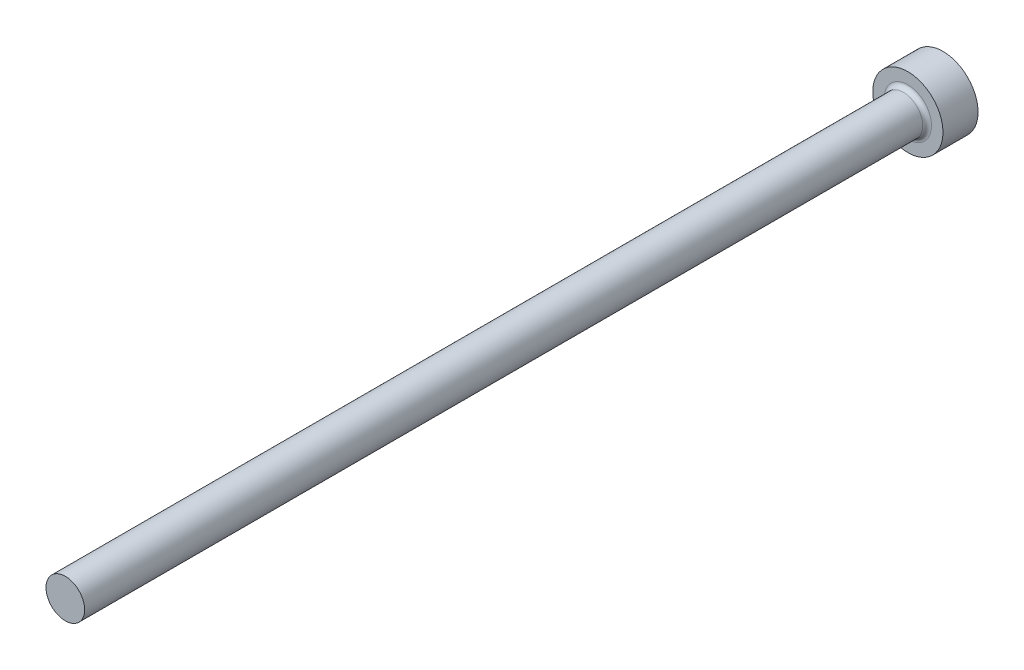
ISO-10303-21;
HEADER;
FILE_DESCRIPTION(('STEP AP214'),'2;1');
FILE_NAME('part.step','',(''),(''),'','','');
FILE_SCHEMA(('AUTOMOTIVE_DESIGN { 1 0 10303 214 1 1 1 1 }'));
ENDSEC;
DATA;
#1=APPLICATION_CONTEXT('core data for automotive mechanical design processes');
#2=APPLICATION_PROTOCOL_DEFINITION('international standard','automotive_design',2000,#1);
#3=PRODUCT_CONTEXT('',#1,'mechanical');
#4=PRODUCT('Part','Part','',(#3));
#5=PRODUCT_RELATED_PRODUCT_CATEGORY('part','',(#4));
#6=PRODUCT_DEFINITION_FORMATION('','',#4);
#7=PRODUCT_DEFINITION_CONTEXT('part definition',#1,'design');
#8=PRODUCT_DEFINITION('design','',#6,#7);
#9=PRODUCT_DEFINITION_SHAPE('','',#8);
#10=(LENGTH_UNIT() NAMED_UNIT(*) SI_UNIT(.MILLI.,.METRE.));
#11=(NAMED_UNIT(*) PLANE_ANGLE_UNIT() SI_UNIT($,.RADIAN.));
#12=(NAMED_UNIT(*) SI_UNIT($,.STERADIAN.) SOLID_ANGLE_UNIT());
#13=UNCERTAINTY_MEASURE_WITH_UNIT(LENGTH_MEASURE(1.E-05),#10,'distance_accuracy_value','');
#14=(GEOMETRIC_REPRESENTATION_CONTEXT(3) GLOBAL_UNCERTAINTY_ASSIGNED_CONTEXT((#13)) GLOBAL_UNIT_ASSIGNED_CONTEXT((#10,
#11,#12)) REPRESENTATION_CONTEXT('',''));
#15=CARTESIAN_POINT('',(0.,0.,0.));
#16=DIRECTION('',(0.,0.,1.));
#17=DIRECTION('',(1.,0.,0.));
#18=AXIS2_PLACEMENT_3D('',#15,#16,#17);
#19=CARTESIAN_POINT('',(4.,0.,4.));
#20=DIRECTION('',(0.,0.,-1.));
#21=DIRECTION('',(-1.,0.,0.));
#22=AXIS2_PLACEMENT_3D('',#19,#20,#21);
#23=PLANE('',#22);
#24=CARTESIAN_POINT('',(0.,0.,4.));
#25=DIRECTION('',(0.,0.,-1.));
#26=DIRECTION('',(-1.,0.,0.));
#27=AXIS2_PLACEMENT_3D('',#24,#25,#26);
#28=CIRCLE('',#27,2.70000000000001);
#29=CARTESIAN_POINT('',(-2.70000000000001,0.,4.));
#30=VERTEX_POINT('',#29);
#31=EDGE_CURVE('E40',#30,#30,#28,.T.);
#32=ORIENTED_EDGE('',*,*,#31,.T.);
#33=EDGE_LOOP('',(#32));
#34=FACE_BOUND('',#33,.T.);
#35=CARTESIAN_POINT('',(0.,0.,4.));
#36=DIRECTION('',(0.,0.,-1.));
#37=DIRECTION('',(-1.,0.,0.));
#38=AXIS2_PLACEMENT_3D('',#35,#36,#37);
#39=CIRCLE('',#38,4.);
#40=CARTESIAN_POINT('',(-4.,0.,4.));
#41=VERTEX_POINT('',#40);
#42=EDGE_CURVE('E44',#41,#41,#39,.T.);
#43=ORIENTED_EDGE('',*,*,#42,.F.);
#44=EDGE_LOOP('',(#43));
#45=FACE_BOUND('',#44,.T.);
#46=ADVANCED_FACE('F33',(#34,#45),#23,.F.);
#47=CARTESIAN_POINT('',(0.,0.,-9.03322817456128));
#48=DIRECTION('',(0.,0.,-1.));
#49=DIRECTION('',(-1.,0.,0.));
#50=AXIS2_PLACEMENT_3D('',#47,#48,#49);
#51=CYLINDRICAL_SURFACE('',#50,4.);
#52=CARTESIAN_POINT('',(0.,0.,0.));
#53=DIRECTION('',(0.,0.,-1.));
#54=DIRECTION('',(-1.,0.,0.));
#55=AXIS2_PLACEMENT_3D('',#52,#53,#54);
#56=CIRCLE('',#55,4.);
#57=CARTESIAN_POINT('',(-4.,0.,0.));
#58=VERTEX_POINT('',#57);
#59=EDGE_CURVE('E48',#58,#58,#56,.T.);
#60=ORIENTED_EDGE('',*,*,#59,.F.);
#61=EDGE_LOOP('',(#60));
#62=FACE_BOUND('',#61,.T.);
#63=ORIENTED_EDGE('',*,*,#42,.T.);
#64=EDGE_LOOP('',(#63));
#65=FACE_BOUND('',#64,.T.);
#66=ADVANCED_FACE('F68',(#62,#65),#51,.T.);
#67=CARTESIAN_POINT('',(0.,0.,0.));
#68=DIRECTION('',(0.,0.,1.));
#69=DIRECTION('',(1.,0.,0.));
#70=AXIS2_PLACEMENT_3D('',#67,#68,#69);
#71=PLANE('',#70);
#72=ORIENTED_EDGE('',*,*,#59,.T.);
#73=EDGE_LOOP('',(#72));
#74=FACE_BOUND('',#73,.T.);
#75=ADVANCED_FACE('F61',(#74),#71,.F.);
#76=CARTESIAN_POINT('',(0.,0.,100.));
#77=DIRECTION('',(0.,0.,-1.));
#78=DIRECTION('',(-1.,0.,0.));
#79=AXIS2_PLACEMENT_3D('',#76,#77,#78);
#80=PLANE('',#79);
#81=CARTESIAN_POINT('',(0.,0.,100.));
#82=DIRECTION('',(0.,0.,-1.));
#83=DIRECTION('',(-1.,0.,0.));
#84=AXIS2_PLACEMENT_3D('',#81,#82,#83);
#85=CIRCLE('',#84,2.20000000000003);
#86=CARTESIAN_POINT('',(-2.20000000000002,0.,100.));
#87=VERTEX_POINT('',#86);
#88=EDGE_CURVE('E53',#87,#87,#85,.T.);
#89=ORIENTED_EDGE('',*,*,#88,.F.);
#90=EDGE_LOOP('',(#89));
#91=FACE_BOUND('',#90,.T.);
#92=ADVANCED_FACE('F59',(#91),#80,.F.);
#93=CARTESIAN_POINT('',(0.,0.,-9.03322817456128));
#94=DIRECTION('',(0.,0.,-1.));
#95=DIRECTION('',(-1.,0.,0.));
#96=AXIS2_PLACEMENT_3D('',#93,#94,#95);
#97=CYLINDRICAL_SURFACE('',#96,2.20000000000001);
#98=CARTESIAN_POINT('',(0.,0.,4.5));
#99=DIRECTION('',(0.,0.,-1.));
#100=DIRECTION('',(-1.,0.,0.));
#101=AXIS2_PLACEMENT_3D('',#98,#99,#100);
#102=CIRCLE('',#101,2.20000000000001);
#103=CARTESIAN_POINT('',(-2.20000000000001,0.,4.5));
#104=VERTEX_POINT('',#103);
#105=EDGE_CURVE('E10',#104,#104,#102,.F.);
#106=ORIENTED_EDGE('',*,*,#105,.T.);
#107=EDGE_LOOP('',(#106));
#108=FACE_BOUND('',#107,.T.);
#109=ORIENTED_EDGE('',*,*,#88,.T.);
#110=EDGE_LOOP('',(#109));
#111=FACE_BOUND('',#110,.T.);
#112=ADVANCED_FACE('F57',(#108,#111),#97,.T.);
#113=CARTESIAN_POINT('',(0.,0.,4.5));
#114=DIRECTION('',(0.,0.,-1.));
#115=DIRECTION('',(-1.,0.,0.));
#116=AXIS2_PLACEMENT_3D('',#113,#114,#115);
#117=TOROIDAL_SURFACE('',#116,2.70000000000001,0.5);
#118=ORIENTED_EDGE('',*,*,#105,.F.);
#119=EDGE_LOOP('',(#118));
#120=FACE_BOUND('',#119,.T.);
#121=ORIENTED_EDGE('',*,*,#31,.F.);
#122=EDGE_LOOP('',(#121));
#123=FACE_BOUND('',#122,.T.);
#124=ADVANCED_FACE('F35',(#120,#123),#117,.F.);
#125=CLOSED_SHELL('',(#46,#66,#75,#92,#112,#124));
#126=MANIFOLD_SOLID_BREP('B2',#125);
#127=ADVANCED_BREP_SHAPE_REPRESENTATION('',(#18,#126),#14);
#128=SHAPE_DEFINITION_REPRESENTATION(#9,#127);
ENDSEC;
END-ISO-10303-21;
